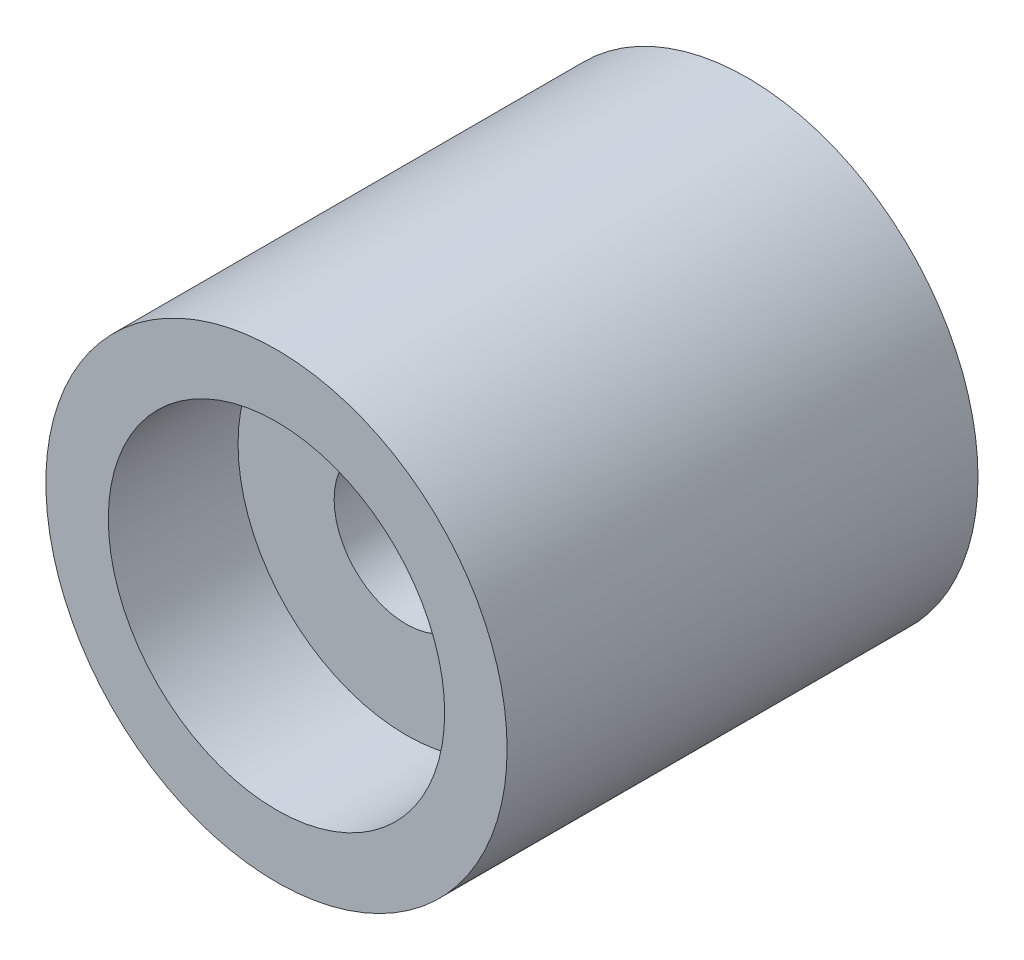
ISO-10303-21;
HEADER;
FILE_DESCRIPTION(('STEP AP214'),'2;1');
FILE_NAME('part.step','',(''),(''),'','','');
FILE_SCHEMA(('AUTOMOTIVE_DESIGN { 1 0 10303 214 1 1 1 1 }'));
ENDSEC;
DATA;
#1=APPLICATION_CONTEXT('core data for automotive mechanical design processes');
#2=APPLICATION_PROTOCOL_DEFINITION('international standard','automotive_design',2000,#1);
#3=PRODUCT_CONTEXT('',#1,'mechanical');
#4=PRODUCT('Part','Part','',(#3));
#5=PRODUCT_RELATED_PRODUCT_CATEGORY('part','',(#4));
#6=PRODUCT_DEFINITION_FORMATION('','',#4);
#7=PRODUCT_DEFINITION_CONTEXT('part definition',#1,'design');
#8=PRODUCT_DEFINITION('design','',#6,#7);
#9=PRODUCT_DEFINITION_SHAPE('','',#8);
#10=(LENGTH_UNIT() NAMED_UNIT(*) SI_UNIT(.MILLI.,.METRE.));
#11=(NAMED_UNIT(*) PLANE_ANGLE_UNIT() SI_UNIT($,.RADIAN.));
#12=(NAMED_UNIT(*) SI_UNIT($,.STERADIAN.) SOLID_ANGLE_UNIT());
#13=UNCERTAINTY_MEASURE_WITH_UNIT(LENGTH_MEASURE(1.E-05),#10,'distance_accuracy_value','');
#14=(GEOMETRIC_REPRESENTATION_CONTEXT(3) GLOBAL_UNCERTAINTY_ASSIGNED_CONTEXT((#13)) GLOBAL_UNIT_ASSIGNED_CONTEXT((#10,
#11,#12)) REPRESENTATION_CONTEXT('',''));
#15=CARTESIAN_POINT('',(0.,0.,0.));
#16=DIRECTION('',(0.,0.,1.));
#17=DIRECTION('',(1.,0.,0.));
#18=AXIS2_PLACEMENT_3D('',#15,#16,#17);
#19=CARTESIAN_POINT('',(0.,-29.5,-24.5));
#20=DIRECTION('',(0.,0.,1.));
#21=DIRECTION('',(-1.,0.,0.));
#22=AXIS2_PLACEMENT_3D('',#19,#20,#21);
#23=PLANE('',#22);
#24=CARTESIAN_POINT('',(0.,0.,-24.5));
#25=DIRECTION('',(0.,0.,1.));
#26=DIRECTION('',(1.,0.,0.));
#27=AXIS2_PLACEMENT_3D('',#24,#25,#26);
#28=CIRCLE('',#27,14.);
#29=CARTESIAN_POINT('',(14.,0.,-24.5));
#30=VERTEX_POINT('',#29);
#31=EDGE_CURVE('E35',#30,#30,#28,.T.);
#32=ORIENTED_EDGE('',*,*,#31,.T.);
#33=EDGE_LOOP('',(#32));
#34=FACE_BOUND('',#33,.T.);
#35=CARTESIAN_POINT('',(0.,0.,-24.5));
#36=DIRECTION('',(0.,0.,1.));
#37=DIRECTION('',(1.,0.,0.));
#38=AXIS2_PLACEMENT_3D('',#35,#36,#37);
#39=CIRCLE('',#38,24.);
#40=CARTESIAN_POINT('',(24.,0.,-24.5));
#41=VERTEX_POINT('',#40);
#42=EDGE_CURVE('E38',#41,#41,#39,.T.);
#43=ORIENTED_EDGE('',*,*,#42,.F.);
#44=EDGE_LOOP('',(#43));
#45=FACE_BOUND('',#44,.T.);
#46=ADVANCED_FACE('F12',(#34,#45),#23,.F.);
#47=CARTESIAN_POINT('',(0.,-29.5,24.5));
#48=DIRECTION('',(0.,0.,-1.));
#49=DIRECTION('',(1.,0.,0.));
#50=AXIS2_PLACEMENT_3D('',#47,#48,#49);
#51=PLANE('',#50);
#52=CARTESIAN_POINT('',(0.,0.,24.5));
#53=DIRECTION('',(0.,0.,1.));
#54=DIRECTION('',(1.,0.,0.));
#55=AXIS2_PLACEMENT_3D('',#52,#53,#54);
#56=CIRCLE('',#55,17.499999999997);
#57=CARTESIAN_POINT('',(17.499999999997,0.,24.5));
#58=VERTEX_POINT('',#57);
#59=EDGE_CURVE('E32',#58,#58,#56,.T.);
#60=ORIENTED_EDGE('',*,*,#59,.F.);
#61=EDGE_LOOP('',(#60));
#62=FACE_BOUND('',#61,.T.);
#63=CARTESIAN_POINT('',(0.,0.,24.5));
#64=DIRECTION('',(0.,0.,1.));
#65=DIRECTION('',(1.,0.,0.));
#66=AXIS2_PLACEMENT_3D('',#63,#64,#65);
#67=CIRCLE('',#66,24.);
#68=CARTESIAN_POINT('',(24.,0.,24.5));
#69=VERTEX_POINT('',#68);
#70=EDGE_CURVE('E39',#69,#69,#67,.T.);
#71=ORIENTED_EDGE('',*,*,#70,.T.);
#72=EDGE_LOOP('',(#71));
#73=FACE_BOUND('',#72,.T.);
#74=ADVANCED_FACE('F49',(#62,#73),#51,.F.);
#75=CARTESIAN_POINT('',(0.,-14.999999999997,11.));
#76=DIRECTION('',(0.,0.,-1.));
#77=DIRECTION('',(1.,0.,0.));
#78=AXIS2_PLACEMENT_3D('',#75,#76,#77);
#79=PLANE('',#78);
#80=CARTESIAN_POINT('',(0.,0.,11.));
#81=DIRECTION('',(0.,0.,1.));
#82=DIRECTION('',(-1.,0.,0.));
#83=AXIS2_PLACEMENT_3D('',#80,#81,#82);
#84=CIRCLE('',#83,7.49999999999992);
#85=CARTESIAN_POINT('',(-7.49999999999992,0.,11.));
#86=VERTEX_POINT('',#85);
#87=EDGE_CURVE('E8',#86,#86,#84,.T.);
#88=ORIENTED_EDGE('',*,*,#87,.F.);
#89=EDGE_LOOP('',(#88));
#90=FACE_BOUND('',#89,.T.);
#91=CARTESIAN_POINT('',(0.,0.,11.));
#92=DIRECTION('',(0.,0.,1.));
#93=DIRECTION('',(1.,0.,0.));
#94=AXIS2_PLACEMENT_3D('',#91,#92,#93);
#95=CIRCLE('',#94,17.499999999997);
#96=CARTESIAN_POINT('',(17.499999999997,0.,11.));
#97=VERTEX_POINT('',#96);
#98=EDGE_CURVE('E27',#97,#97,#95,.T.);
#99=ORIENTED_EDGE('',*,*,#98,.T.);
#100=EDGE_LOOP('',(#99));
#101=FACE_BOUND('',#100,.T.);
#102=ADVANCED_FACE('F14',(#90,#101),#79,.F.);
#103=CARTESIAN_POINT('',(0.,0.,29.5));
#104=DIRECTION('',(0.,0.,1.));
#105=DIRECTION('',(-1.,0.,0.));
#106=AXIS2_PLACEMENT_3D('',#103,#104,#105);
#107=CYLINDRICAL_SURFACE('',#106,7.49999999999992);
#108=CARTESIAN_POINT('',(0.,0.,-11.0000000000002));
#109=DIRECTION('',(0.,0.,1.));
#110=DIRECTION('',(-1.,0.,0.));
#111=AXIS2_PLACEMENT_3D('',#108,#109,#110);
#112=CIRCLE('',#111,7.49999999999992);
#113=CARTESIAN_POINT('',(-7.49999999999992,0.,-11.0000000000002));
#114=VERTEX_POINT('',#113);
#115=EDGE_CURVE('E19',#114,#114,#112,.T.);
#116=ORIENTED_EDGE('',*,*,#115,.F.);
#117=EDGE_LOOP('',(#116));
#118=FACE_BOUND('',#117,.T.);
#119=ORIENTED_EDGE('',*,*,#87,.T.);
#120=EDGE_LOOP('',(#119));
#121=FACE_BOUND('',#120,.T.);
#122=ADVANCED_FACE('F68',(#118,#121),#107,.F.);
#123=CARTESIAN_POINT('',(0.,-14.,-11.0000000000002));
#124=DIRECTION('',(0.,0.,1.));
#125=DIRECTION('',(-1.,0.,0.));
#126=AXIS2_PLACEMENT_3D('',#123,#124,#125);
#127=PLANE('',#126);
#128=CARTESIAN_POINT('',(0.,0.,-11.0000000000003));
#129=DIRECTION('',(0.,0.,1.));
#130=DIRECTION('',(-1.,0.,0.));
#131=AXIS2_PLACEMENT_3D('',#128,#129,#130);
#132=CIRCLE('',#131,14.);
#133=CARTESIAN_POINT('',(-14.,0.,-11.0000000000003));
#134=VERTEX_POINT('',#133);
#135=EDGE_CURVE('E23',#134,#134,#132,.T.);
#136=ORIENTED_EDGE('',*,*,#135,.F.);
#137=EDGE_LOOP('',(#136));
#138=FACE_BOUND('',#137,.T.);
#139=ORIENTED_EDGE('',*,*,#115,.T.);
#140=EDGE_LOOP('',(#139));
#141=FACE_BOUND('',#140,.T.);
#142=ADVANCED_FACE('F65',(#138,#141),#127,.F.);
#143=CARTESIAN_POINT('',(0.,0.,29.5));
#144=DIRECTION('',(0.,0.,1.));
#145=DIRECTION('',(-1.,0.,0.));
#146=AXIS2_PLACEMENT_3D('',#143,#144,#145);
#147=CYLINDRICAL_SURFACE('',#146,14.);
#148=ORIENTED_EDGE('',*,*,#135,.T.);
#149=EDGE_LOOP('',(#148));
#150=FACE_BOUND('',#149,.T.);
#151=ORIENTED_EDGE('',*,*,#31,.F.);
#152=EDGE_LOOP('',(#151));
#153=FACE_BOUND('',#152,.T.);
#154=ADVANCED_FACE('F61',(#150,#153),#147,.F.);
#155=CARTESIAN_POINT('',(0.,0.,29.5));
#156=DIRECTION('',(0.,0.,1.));
#157=DIRECTION('',(-1.,0.,0.));
#158=AXIS2_PLACEMENT_3D('',#155,#156,#157);
#159=CYLINDRICAL_SURFACE('',#158,17.499999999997);
#160=ORIENTED_EDGE('',*,*,#98,.F.);
#161=EDGE_LOOP('',(#160));
#162=FACE_BOUND('',#161,.T.);
#163=ORIENTED_EDGE('',*,*,#59,.T.);
#164=EDGE_LOOP('',(#163));
#165=FACE_BOUND('',#164,.T.);
#166=ADVANCED_FACE('F64',(#162,#165),#159,.F.);
#167=CARTESIAN_POINT('',(0.,0.,-24.5));
#168=DIRECTION('',(0.,0.,1.));
#169=DIRECTION('',(1.,0.,0.));
#170=AXIS2_PLACEMENT_3D('',#167,#168,#169);
#171=CYLINDRICAL_SURFACE('',#170,24.);
#172=ORIENTED_EDGE('',*,*,#42,.T.);
#173=EDGE_LOOP('',(#172));
#174=FACE_BOUND('',#173,.T.);
#175=ORIENTED_EDGE('',*,*,#70,.F.);
#176=EDGE_LOOP('',(#175));
#177=FACE_BOUND('',#176,.T.);
#178=ADVANCED_FACE('F45',(#174,#177),#171,.T.);
#179=CLOSED_SHELL('',(#46,#74,#102,#122,#142,#154,#166,#178));
#180=MANIFOLD_SOLID_BREP('B1',#179);
#181=ADVANCED_BREP_SHAPE_REPRESENTATION('',(#18,#180),#14);
#182=SHAPE_DEFINITION_REPRESENTATION(#9,#181);
ENDSEC;
END-ISO-10303-21;
